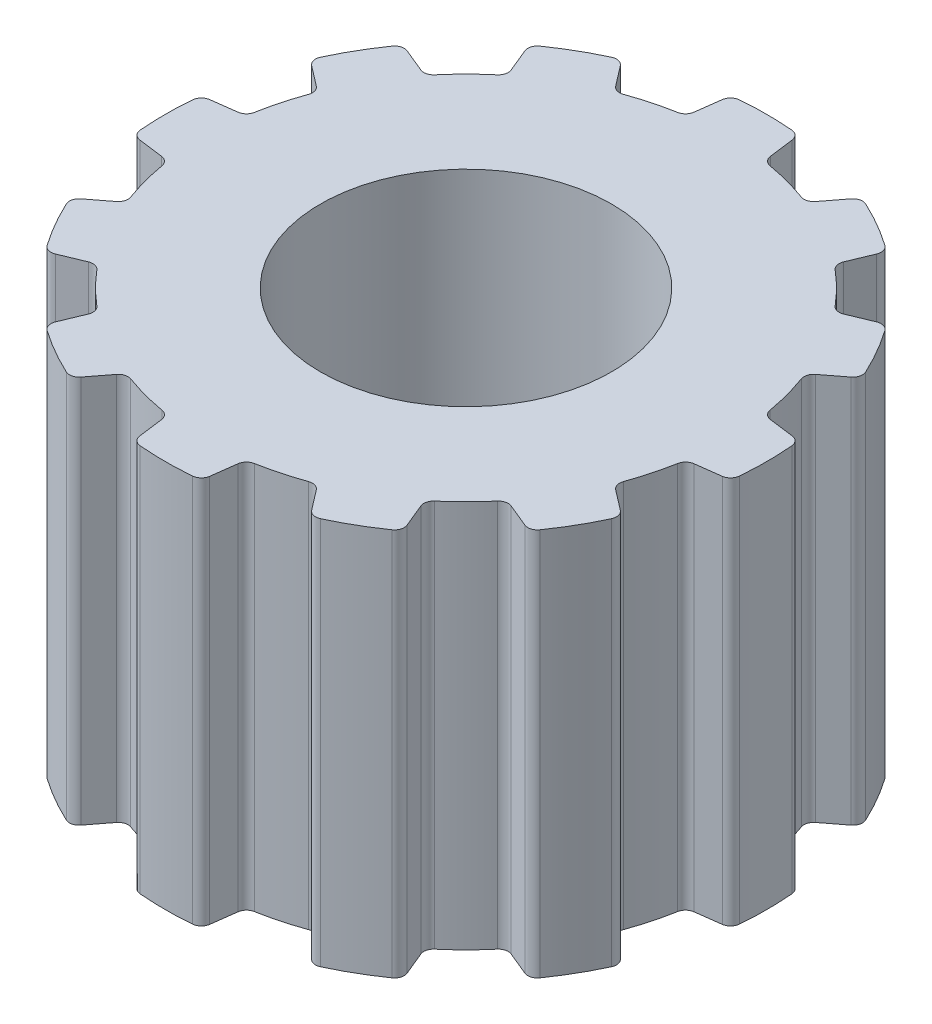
from build123d import *

# Parameters (mm, degrees)
SKETCH1_R                = 6.75
SKETCH1_R_2              = 3.75
EXTRUDE1_DEPTH           = 10
EXTRUDE2_DEPTH           = 10
FILLET1_R                = 0.25
FILLET2_R                = 0.25
CIRPATTERN1_COUNT        = 12
FILLET1_OF_CIRPATTERN1_R = 0.25
FILLET2_OF_CIRPATTERN1_R = 0.25


with BuildPart() as part:
    # Sketch1 → Extrude1 (new body)
    with BuildSketch(Plane(origin=(0, 0, 0), x_dir=(1, 0, 0), z_dir=(0, 1, 0))):
        with Locations(Location((0, 0, 0), (0, 0, 270))):
            Circle(SKETCH1_R)
        with Locations(Location((0, 0, 0), (0, 0, 270))):
            Circle(SKETCH1_R_2, mode=Mode.SUBTRACT)
    extrude(amount=EXTRUDE1_DEPTH)

    # Sketch1_3 → Extrude2 (add)
    with BuildSketch(Plane(origin=(0, 0, 0), x_dir=(1, 0, 0), z_dir=(0, 1, 0))):
        with BuildLine():
            ThreePointArc((-1.010135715, 6.67398875), (-0.506495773, 6.730970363), (0, 6.75))
            Line((0, 6.75), (0, 7.75))
            ThreePointArc((0, 7.75), (-0.438201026, 7.737601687), (-0.875, 7.700446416))
            Line((-0.875, 7.700446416), (-1.010135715, 6.67398875))
        make_face()
        with BuildLine():
            Line((0, 7.75), (0, 6.75))
            ThreePointArc((0, 6.75), (0.506495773, 6.730970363), (1.010135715, 6.67398875))
            Line((1.010135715, 6.67398875), (0.875, 7.700446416))
            ThreePointArc((0.875, 7.700446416), (0.438201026, 7.737601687), (0, 7.75))
        make_face()
    extrude2 = extrude(amount=EXTRUDE2_DEPTH)

    # Fillet1
    fillet1_edges = [part.edges().sort_by_distance(p)[0] for p in [
        (-1.010135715, 5, -6.67398875),
        (1.010135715, 5, -6.67398875),
    ]]
    fillet(fillet1_edges, radius=FILLET1_R)

    # Fillet2
    fillet2_edges = [part.edges().sort_by_distance(p)[0] for p in [
        (0.875, 5, -7.700446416),
        (-0.875, 5, -7.700446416),
    ]]
    fillet(fillet2_edges, radius=FILLET2_R)

    # CirPattern1: Extrude2 ×12 about axis
    cirpattern1_axis = Axis((0, 0, 0), (0, 1, 0))
    for i in range(1, CIRPATTERN1_COUNT):
        add(extrude2.rotate(cirpattern1_axis, i * 360 / CIRPATTERN1_COUNT))

    # Fillet1 of CirPattern1
    fillet1_of_cirpattern1_edges = [part.edges().sort_by_distance(p)[0] for p in [
        (-4.211797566, 5, -5.274775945),
        (-2.462191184, 5, -6.28491166),
        (-6.28491166, 5, -2.462191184),
        (-5.274775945, 5, -4.211797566),
        (-6.67398875, 5, 1.010135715),
        (-6.67398875, 5, -1.010135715),
        (-5.274775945, 5, 4.211797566),
        (-6.28491166, 5, 2.462191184),
        (-2.462191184, 5, 6.28491166),
        (-4.211797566, 5, 5.274775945),
        (1.010135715, 5, 6.67398875),
        (-1.010135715, 5, 6.67398875),
        (4.211797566, 5, 5.274775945),
        (2.462191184, 5, 6.28491166),
        (6.28491166, 5, 2.462191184),
        (5.274775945, 5, 4.211797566),
        (6.67398875, 5, -1.010135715),
        (6.67398875, 5, 1.010135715),
        (5.274775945, 5, -4.211797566),
        (6.28491166, 5, -2.462191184),
        (2.462191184, 5, -6.28491166),
        (4.211797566, 5, -5.274775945),
    ]]
    fillet(fillet1_of_cirpattern1_edges, radius=FILLET1_OF_CIRPATTERN1_R)

    # Fillet2 of CirPattern1
    fillet2_of_cirpattern1_edges = [part.edges().sort_by_distance(p)[0] for p in [
        (-3.09245098, 5, -7.106282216),
        (-4.607995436, 5, -6.231282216),
        (-6.231282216, 5, -4.607995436),
        (-7.106282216, 5, -3.09245098),
        (-7.700446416, 5, -0.875),
        (-7.700446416, 5, 0.875),
        (-7.106282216, 5, 3.09245098),
        (-6.231282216, 5, 4.607995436),
        (-4.607995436, 5, 6.231282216),
        (-3.09245098, 5, 7.106282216),
        (-0.875, 5, 7.700446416),
        (0.875, 5, 7.700446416),
        (3.09245098, 5, 7.106282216),
        (4.607995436, 5, 6.231282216),
        (6.231282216, 5, 4.607995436),
        (7.106282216, 5, 3.09245098),
        (7.700446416, 5, 0.875),
        (7.700446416, 5, -0.875),
        (7.106282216, 5, -3.09245098),
        (6.231282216, 5, -4.607995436),
        (4.607995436, 5, -6.231282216),
        (3.09245098, 5, -7.106282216),
    ]]
    fillet(fillet2_of_cirpattern1_edges, radius=FILLET2_OF_CIRPATTERN1_R)


solid = part.part
